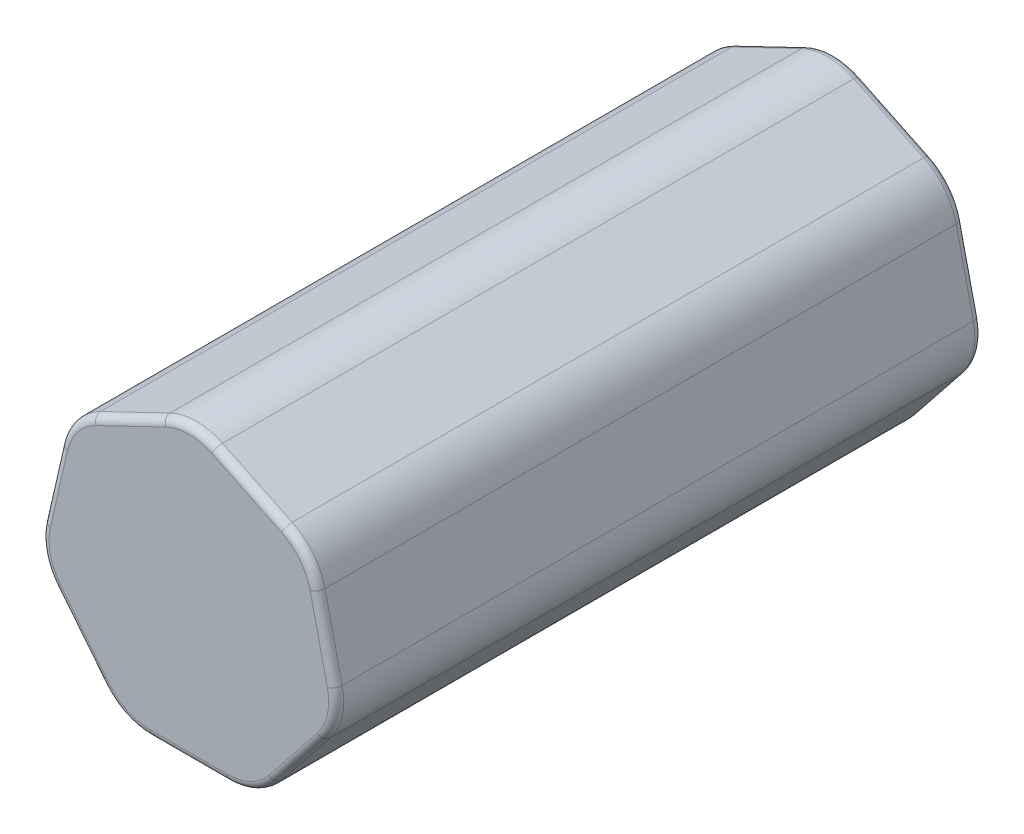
ISO-10303-21;
HEADER;
FILE_DESCRIPTION(('STEP AP214'),'2;1');
FILE_NAME('part.step','',(''),(''),'','','');
FILE_SCHEMA(('AUTOMOTIVE_DESIGN { 1 0 10303 214 1 1 1 1 }'));
ENDSEC;
DATA;
#1=APPLICATION_CONTEXT('core data for automotive mechanical design processes');
#2=APPLICATION_PROTOCOL_DEFINITION('international standard','automotive_design',2000,#1);
#3=PRODUCT_CONTEXT('',#1,'mechanical');
#4=PRODUCT('Part','Part','',(#3));
#5=PRODUCT_RELATED_PRODUCT_CATEGORY('part','',(#4));
#6=PRODUCT_DEFINITION_FORMATION('','',#4);
#7=PRODUCT_DEFINITION_CONTEXT('part definition',#1,'design');
#8=PRODUCT_DEFINITION('design','',#6,#7);
#9=PRODUCT_DEFINITION_SHAPE('','',#8);
#10=(LENGTH_UNIT() NAMED_UNIT(*) SI_UNIT(.MILLI.,.METRE.));
#11=(NAMED_UNIT(*) PLANE_ANGLE_UNIT() SI_UNIT($,.RADIAN.));
#12=(NAMED_UNIT(*) SI_UNIT($,.STERADIAN.) SOLID_ANGLE_UNIT());
#13=UNCERTAINTY_MEASURE_WITH_UNIT(LENGTH_MEASURE(1.E-05),#10,'distance_accuracy_value','');
#14=(GEOMETRIC_REPRESENTATION_CONTEXT(3) GLOBAL_UNCERTAINTY_ASSIGNED_CONTEXT((#13)) GLOBAL_UNIT_ASSIGNED_CONTEXT((#10,
#11,#12)) REPRESENTATION_CONTEXT('',''));
#15=CARTESIAN_POINT('',(0.,0.,0.));
#16=DIRECTION('',(0.,0.,1.));
#17=DIRECTION('',(1.,0.,0.));
#18=AXIS2_PLACEMENT_3D('',#15,#16,#17);
#19=CARTESIAN_POINT('',(32.0200762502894,-7.30837345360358,67.945));
#20=DIRECTION('',(-0.974927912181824,-0.222520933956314,0.));
#21=DIRECTION('',(0.222520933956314,-0.974927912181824,0.));
#22=AXIS2_PLACEMENT_3D('',#19,#20,#21);
#23=PLANE('',#22);
#24=DIRECTION('',(0.,0.,-1.));
#25=VECTOR('',#24,1.);
#26=CARTESIAN_POINT('',(27.0390449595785,14.5149505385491,67.945));
#27=LINE('',#26,#25);
#28=CARTESIAN_POINT('',(27.0390449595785,14.5149505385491,-66.3575));
#29=VERTEX_POINT('',#28);
#30=CARTESIAN_POINT('',(27.0390449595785,14.5149505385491,66.3575));
#31=VERTEX_POINT('',#30);
#32=EDGE_CURVE('E435',#29,#31,#27,.F.);
#33=ORIENTED_EDGE('',*,*,#32,.T.);
#34=DIRECTION('',(-0.222520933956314,0.974927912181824,0.));
#35=VECTOR('',#34,1.);
#36=CARTESIAN_POINT('',(30.6591387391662,-1.34571662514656,66.3575));
#37=LINE('',#36,#35);
#38=CARTESIAN_POINT('',(30.6591387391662,-1.34571662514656,66.3575));
#39=VERTEX_POINT('',#38);
#40=EDGE_CURVE('E272',#31,#39,#37,.F.);
#41=ORIENTED_EDGE('',*,*,#40,.T.);
#42=DIRECTION('',(0.,0.,-1.));
#43=VECTOR('',#42,1.);
#44=CARTESIAN_POINT('',(30.6591387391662,-1.34571662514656,67.945));
#45=LINE('',#44,#43);
#46=CARTESIAN_POINT('',(30.6591387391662,-1.34571662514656,-66.3575));
#47=VERTEX_POINT('',#46);
#48=EDGE_CURVE('E430',#39,#47,#45,.T.);
#49=ORIENTED_EDGE('',*,*,#48,.T.);
#50=DIRECTION('',(-0.222520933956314,0.974927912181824,0.));
#51=VECTOR('',#50,1.);
#52=CARTESIAN_POINT('',(32.0200762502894,-7.30837345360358,-66.3575));
#53=LINE('',#52,#51);
#54=EDGE_CURVE('E270',#47,#29,#53,.T.);
#55=ORIENTED_EDGE('',*,*,#54,.T.);
#56=EDGE_LOOP('',(#33,#41,#49,#55));
#57=FACE_BOUND('',#56,.T.);
#58=ADVANCED_FACE('F35',(#57),#23,.F.);
#59=CARTESIAN_POINT('',(25.6781074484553,20.4776073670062,67.945));
#60=DIRECTION('',(-0.433883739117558,-0.900968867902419,0.));
#61=DIRECTION('',(0.900968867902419,-0.433883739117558,0.));
#62=AXIS2_PLACEMENT_3D('',#59,#60,#61);
#63=PLANE('',#62);
#64=DIRECTION('',(0.,0.,-1.));
#65=VECTOR('',#64,1.);
#66=CARTESIAN_POINT('',(5.51032348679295,30.1899002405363,67.945));
#67=LINE('',#66,#65);
#68=CARTESIAN_POINT('',(5.51032348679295,30.1899002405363,-66.3575));
#69=VERTEX_POINT('',#68);
#70=CARTESIAN_POINT('',(5.51032348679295,30.1899002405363,66.3575));
#71=VERTEX_POINT('',#70);
#72=EDGE_CURVE('E421',#69,#71,#67,.F.);
#73=ORIENTED_EDGE('',*,*,#72,.T.);
#74=DIRECTION('',(-0.900968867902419,0.433883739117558,0.));
#75=VECTOR('',#74,1.);
#76=CARTESIAN_POINT('',(20.1677839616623,23.1312392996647,66.3575));
#77=LINE('',#76,#75);
#78=CARTESIAN_POINT('',(20.1677839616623,23.1312392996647,66.3575));
#79=VERTEX_POINT('',#78);
#80=EDGE_CURVE('E264',#71,#79,#77,.F.);
#81=ORIENTED_EDGE('',*,*,#80,.T.);
#82=DIRECTION('',(0.,0.,-1.));
#83=VECTOR('',#82,1.);
#84=CARTESIAN_POINT('',(20.1677839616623,23.1312392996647,67.945));
#85=LINE('',#84,#83);
#86=CARTESIAN_POINT('',(20.1677839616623,23.1312392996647,-66.3575));
#87=VERTEX_POINT('',#86);
#88=EDGE_CURVE('E424',#79,#87,#85,.T.);
#89=ORIENTED_EDGE('',*,*,#88,.T.);
#90=DIRECTION('',(-0.900968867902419,0.433883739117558,0.));
#91=VECTOR('',#90,1.);
#92=CARTESIAN_POINT('',(25.6781074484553,20.4776073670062,-66.3575));
#93=LINE('',#92,#91);
#94=EDGE_CURVE('E262',#87,#69,#93,.T.);
#95=ORIENTED_EDGE('',*,*,#94,.T.);
#96=EDGE_LOOP('',(#73,#81,#89,#95));
#97=FACE_BOUND('',#96,.T.);
#98=ADVANCED_FACE('F420',(#97),#63,.F.);
#99=CARTESIAN_POINT('',(0.,32.8435321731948,67.945));
#100=DIRECTION('',(0.433883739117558,-0.900968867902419,0.));
#101=DIRECTION('',(0.900968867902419,0.433883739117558,0.));
#102=AXIS2_PLACEMENT_3D('',#99,#100,#101);
#103=PLANE('',#102);
#104=DIRECTION('',(0.,0.,-1.));
#105=VECTOR('',#104,1.);
#106=CARTESIAN_POINT('',(-20.1677839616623,23.1312392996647,67.945));
#107=LINE('',#106,#105);
#108=CARTESIAN_POINT('',(-20.1677839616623,23.1312392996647,-66.3575));
#109=VERTEX_POINT('',#108);
#110=CARTESIAN_POINT('',(-20.1677839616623,23.1312392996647,66.3575));
#111=VERTEX_POINT('',#110);
#112=EDGE_CURVE('E432',#109,#111,#107,.F.);
#113=ORIENTED_EDGE('',*,*,#112,.T.);
#114=DIRECTION('',(-0.900968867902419,-0.433883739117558,0.));
#115=VECTOR('',#114,1.);
#116=CARTESIAN_POINT('',(-5.51032348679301,30.1899002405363,66.3575));
#117=LINE('',#116,#115);
#118=CARTESIAN_POINT('',(-5.51032348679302,30.1899002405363,66.3575));
#119=VERTEX_POINT('',#118);
#120=EDGE_CURVE('E256',#111,#119,#117,.F.);
#121=ORIENTED_EDGE('',*,*,#120,.T.);
#122=DIRECTION('',(0.,0.,-1.));
#123=VECTOR('',#122,1.);
#124=CARTESIAN_POINT('',(-5.51032348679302,30.1899002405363,67.945));
#125=LINE('',#124,#123);
#126=CARTESIAN_POINT('',(-5.51032348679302,30.1899002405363,-66.3575));
#127=VERTEX_POINT('',#126);
#128=EDGE_CURVE('E240',#119,#127,#125,.T.);
#129=ORIENTED_EDGE('',*,*,#128,.T.);
#130=DIRECTION('',(-0.900968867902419,-0.433883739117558,0.));
#131=VECTOR('',#130,1.);
#132=CARTESIAN_POINT('',(0.,32.8435321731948,-66.3575));
#133=LINE('',#132,#131);
#134=EDGE_CURVE('E254',#127,#109,#133,.T.);
#135=ORIENTED_EDGE('',*,*,#134,.T.);
#136=EDGE_LOOP('',(#113,#121,#129,#135));
#137=FACE_BOUND('',#136,.T.);
#138=ADVANCED_FACE('F477',(#137),#103,.F.);
#139=CARTESIAN_POINT('',(-25.6781074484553,20.4776073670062,67.945));
#140=DIRECTION('',(0.974927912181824,-0.222520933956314,0.));
#141=DIRECTION('',(0.222520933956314,0.974927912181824,0.));
#142=AXIS2_PLACEMENT_3D('',#139,#140,#141);
#143=PLANE('',#142);
#144=DIRECTION('',(0.,0.,-1.));
#145=VECTOR('',#144,1.);
#146=CARTESIAN_POINT('',(-30.6591387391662,-1.34571662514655,67.945));
#147=LINE('',#146,#145);
#148=CARTESIAN_POINT('',(-30.6591387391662,-1.34571662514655,-66.3575));
#149=VERTEX_POINT('',#148);
#150=CARTESIAN_POINT('',(-30.6591387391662,-1.34571662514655,66.3575));
#151=VERTEX_POINT('',#150);
#152=EDGE_CURVE('E493',#149,#151,#147,.F.);
#153=ORIENTED_EDGE('',*,*,#152,.T.);
#154=DIRECTION('',(-0.222520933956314,-0.974927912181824,0.));
#155=VECTOR('',#154,1.);
#156=CARTESIAN_POINT('',(-27.0390449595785,14.5149505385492,66.3575));
#157=LINE('',#156,#155);
#158=CARTESIAN_POINT('',(-27.0390449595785,14.5149505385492,66.3575));
#159=VERTEX_POINT('',#158);
#160=EDGE_CURVE('E305',#151,#159,#157,.F.);
#161=ORIENTED_EDGE('',*,*,#160,.T.);
#162=DIRECTION('',(0.,0.,-1.));
#163=VECTOR('',#162,1.);
#164=CARTESIAN_POINT('',(-27.0390449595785,14.5149505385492,67.945));
#165=LINE('',#164,#163);
#166=CARTESIAN_POINT('',(-27.0390449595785,14.5149505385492,-66.3575));
#167=VERTEX_POINT('',#166);
#168=EDGE_CURVE('E476',#159,#167,#165,.T.);
#169=ORIENTED_EDGE('',*,*,#168,.T.);
#170=DIRECTION('',(-0.222520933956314,-0.974927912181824,0.));
#171=VECTOR('',#170,1.);
#172=CARTESIAN_POINT('',(-25.6781074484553,20.4776073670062,-66.3575));
#173=LINE('',#172,#171);
#174=EDGE_CURVE('E303',#167,#149,#173,.T.);
#175=ORIENTED_EDGE('',*,*,#174,.T.);
#176=EDGE_LOOP('',(#153,#161,#169,#175));
#177=FACE_BOUND('',#176,.T.);
#178=ADVANCED_FACE('F491',(#177),#143,.F.);
#179=CARTESIAN_POINT('',(-32.0200762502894,-7.30837345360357,67.945));
#180=DIRECTION('',(0.78183148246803,0.623489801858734,0.));
#181=DIRECTION('',(-0.623489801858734,0.78183148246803,0.));
#182=AXIS2_PLACEMENT_3D('',#179,#180,#181);
#183=PLANE('',#182);
#184=DIRECTION('',(0.,0.,-1.));
#185=VECTOR('',#184,1.);
#186=CARTESIAN_POINT('',(-18.0635367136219,-24.8093204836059,67.945));
#187=LINE('',#186,#185);
#188=CARTESIAN_POINT('',(-18.0635367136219,-24.8093204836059,-66.3575));
#189=VERTEX_POINT('',#188);
#190=CARTESIAN_POINT('',(-18.0635367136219,-24.8093204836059,66.3575));
#191=VERTEX_POINT('',#190);
#192=EDGE_CURVE('E366',#189,#191,#187,.F.);
#193=ORIENTED_EDGE('',*,*,#192,.T.);
#194=DIRECTION('',(0.623489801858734,-0.78183148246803,0.));
#195=VECTOR('',#194,1.);
#196=CARTESIAN_POINT('',(-28.206814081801,-12.0900529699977,66.3575));
#197=LINE('',#196,#195);
#198=CARTESIAN_POINT('',(-28.206814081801,-12.0900529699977,66.3575));
#199=VERTEX_POINT('',#198);
#200=EDGE_CURVE('E297',#191,#199,#197,.F.);
#201=ORIENTED_EDGE('',*,*,#200,.T.);
#202=DIRECTION('',(0.,0.,-1.));
#203=VECTOR('',#202,1.);
#204=CARTESIAN_POINT('',(-28.206814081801,-12.0900529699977,67.945));
#205=LINE('',#204,#203);
#206=CARTESIAN_POINT('',(-28.206814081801,-12.0900529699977,-66.3575));
#207=VERTEX_POINT('',#206);
#208=EDGE_CURVE('E494',#199,#207,#205,.T.);
#209=ORIENTED_EDGE('',*,*,#208,.T.);
#210=DIRECTION('',(0.623489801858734,-0.78183148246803,0.));
#211=VECTOR('',#210,1.);
#212=CARTESIAN_POINT('',(-32.0200762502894,-7.30837345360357,-66.3575));
#213=LINE('',#212,#211);
#214=EDGE_CURVE('E295',#207,#189,#213,.T.);
#215=ORIENTED_EDGE('',*,*,#214,.T.);
#216=EDGE_LOOP('',(#193,#201,#209,#215));
#217=FACE_BOUND('',#216,.T.);
#218=ADVANCED_FACE('F802',(#217),#183,.F.);
#219=CARTESIAN_POINT('',(-14.2502745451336,-29.591,67.945));
#220=DIRECTION('',(0.,1.,0.));
#221=DIRECTION('',(-1.,0.,0.));
#222=AXIS2_PLACEMENT_3D('',#219,#220,#221);
#223=PLANE('',#222);
#224=DIRECTION('',(0.,0.,-1.));
#225=VECTOR('',#224,1.);
#226=CARTESIAN_POINT('',(8.13427688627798,-29.591,67.945));
#227=LINE('',#226,#225);
#228=CARTESIAN_POINT('',(8.13427688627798,-29.591,-66.3575));
#229=VERTEX_POINT('',#228);
#230=CARTESIAN_POINT('',(8.13427688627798,-29.591,66.3575));
#231=VERTEX_POINT('',#230);
#232=EDGE_CURVE('E496',#229,#231,#227,.F.);
#233=ORIENTED_EDGE('',*,*,#232,.T.);
#234=DIRECTION('',(1.,0.,0.));
#235=VECTOR('',#234,1.);
#236=CARTESIAN_POINT('',(-8.13427688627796,-29.591,66.3575));
#237=LINE('',#236,#235);
#238=CARTESIAN_POINT('',(-8.13427688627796,-29.591,66.3575));
#239=VERTEX_POINT('',#238);
#240=EDGE_CURVE('E288',#231,#239,#237,.F.);
#241=ORIENTED_EDGE('',*,*,#240,.T.);
#242=DIRECTION('',(0.,0.,-1.));
#243=VECTOR('',#242,1.);
#244=CARTESIAN_POINT('',(-8.13427688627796,-29.591,67.945));
#245=LINE('',#244,#243);
#246=CARTESIAN_POINT('',(-8.13427688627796,-29.591,-66.3575));
#247=VERTEX_POINT('',#246);
#248=EDGE_CURVE('E504',#239,#247,#245,.T.);
#249=ORIENTED_EDGE('',*,*,#248,.T.);
#250=DIRECTION('',(1.,0.,0.));
#251=VECTOR('',#250,1.);
#252=CARTESIAN_POINT('',(-14.2502745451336,-29.591,-66.3575));
#253=LINE('',#252,#251);
#254=EDGE_CURVE('E286',#247,#229,#253,.T.);
#255=ORIENTED_EDGE('',*,*,#254,.T.);
#256=EDGE_LOOP('',(#233,#241,#249,#255));
#257=FACE_BOUND('',#256,.T.);
#258=ADVANCED_FACE('F558',(#257),#223,.F.);
#259=CARTESIAN_POINT('',(14.2502745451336,-29.591,67.945));
#260=DIRECTION('',(-0.78183148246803,0.623489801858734,0.));
#261=DIRECTION('',(-0.623489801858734,-0.78183148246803,0.));
#262=AXIS2_PLACEMENT_3D('',#259,#260,#261);
#263=PLANE('',#262);
#264=DIRECTION('',(0.,0.,-1.));
#265=VECTOR('',#264,1.);
#266=CARTESIAN_POINT('',(28.206814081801,-12.0900529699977,67.945));
#267=LINE('',#266,#265);
#268=CARTESIAN_POINT('',(28.206814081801,-12.0900529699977,-66.3575));
#269=VERTEX_POINT('',#268);
#270=CARTESIAN_POINT('',(28.206814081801,-12.0900529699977,66.3575));
#271=VERTEX_POINT('',#270);
#272=EDGE_CURVE('E507',#269,#271,#267,.F.);
#273=ORIENTED_EDGE('',*,*,#272,.T.);
#274=DIRECTION('',(0.623489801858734,0.78183148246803,0.));
#275=VECTOR('',#274,1.);
#276=CARTESIAN_POINT('',(18.0635367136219,-24.8093204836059,66.3575));
#277=LINE('',#276,#275);
#278=CARTESIAN_POINT('',(18.063536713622,-24.8093204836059,66.3575));
#279=VERTEX_POINT('',#278);
#280=EDGE_CURVE('E280',#271,#279,#277,.F.);
#281=ORIENTED_EDGE('',*,*,#280,.T.);
#282=DIRECTION('',(0.,0.,-1.));
#283=VECTOR('',#282,1.);
#284=CARTESIAN_POINT('',(18.063536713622,-24.8093204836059,67.945));
#285=LINE('',#284,#283);
#286=CARTESIAN_POINT('',(18.063536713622,-24.8093204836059,-66.3575));
#287=VERTEX_POINT('',#286);
#288=EDGE_CURVE('E510',#279,#287,#285,.T.);
#289=ORIENTED_EDGE('',*,*,#288,.T.);
#290=DIRECTION('',(0.623489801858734,0.78183148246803,0.));
#291=VECTOR('',#290,1.);
#292=CARTESIAN_POINT('',(14.2502745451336,-29.591,-66.3575));
#293=LINE('',#292,#291);
#294=EDGE_CURVE('E278',#287,#269,#293,.T.);
#295=ORIENTED_EDGE('',*,*,#294,.T.);
#296=EDGE_LOOP('',(#273,#281,#289,#295));
#297=FACE_BOUND('',#296,.T.);
#298=ADVANCED_FACE('F541',(#297),#263,.F.);
#299=CARTESIAN_POINT('',(0.,0.,67.945));
#300=DIRECTION('',(0.,0.,1.));
#301=DIRECTION('',(1.,0.,0.));
#302=AXIS2_PLACEMENT_3D('',#299,#300,#301);
#303=PLANE('',#302);
#304=DIRECTION('',(-0.900968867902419,-0.433883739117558,0.));
#305=VECTOR('',#304,1.);
#306=CARTESIAN_POINT('',(-19.4789935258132,21.7009512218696,67.945));
#307=LINE('',#306,#305);
#308=CARTESIAN_POINT('',(-4.82153305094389,28.7596121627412,67.945));
#309=VERTEX_POINT('',#308);
#310=CARTESIAN_POINT('',(-19.4789935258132,21.7009512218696,67.945));
#311=VERTEX_POINT('',#310);
#312=EDGE_CURVE('E244',#309,#311,#307,.T.);
#313=ORIENTED_EDGE('',*,*,#312,.T.);
#314=CARTESIAN_POINT('',(-14.6574604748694,11.688934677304,67.945));
#315=DIRECTION('',(0.,0.,1.));
#316=DIRECTION('',(1.,0.,0.));
#317=AXIS2_PLACEMENT_3D('',#314,#315,#316);
#318=CIRCLE('',#317,11.1125);
#319=CARTESIAN_POINT('',(-25.4913468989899,14.1616985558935,67.945));
#320=VERTEX_POINT('',#319);
#321=EDGE_CURVE('E225',#311,#320,#318,.T.);
#322=ORIENTED_EDGE('',*,*,#321,.T.);
#323=DIRECTION('',(-0.222520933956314,-0.974927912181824,0.));
#324=VECTOR('',#323,1.);
#325=CARTESIAN_POINT('',(-29.1114406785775,-1.6989686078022,67.945));
#326=LINE('',#325,#324);
#327=CARTESIAN_POINT('',(-29.1114406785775,-1.6989686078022,67.945));
#328=VERTEX_POINT('',#327);
#329=EDGE_CURVE('E233',#320,#328,#326,.T.);
#330=ORIENTED_EDGE('',*,*,#329,.T.);
#331=CARTESIAN_POINT('',(-18.277554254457,-4.17173248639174,67.945));
#332=DIRECTION('',(0.,0.,1.));
#333=DIRECTION('',(1.,0.,0.));
#334=AXIS2_PLACEMENT_3D('',#331,#332,#333);
#335=CIRCLE('',#334,11.1125);
#336=CARTESIAN_POINT('',(-26.965656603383,-11.1002629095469,67.945));
#337=VERTEX_POINT('',#336);
#338=EDGE_CURVE('E239',#328,#337,#335,.T.);
#339=ORIENTED_EDGE('',*,*,#338,.T.);
#340=DIRECTION('',(0.623489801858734,-0.78183148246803,0.));
#341=VECTOR('',#340,1.);
#342=CARTESIAN_POINT('',(-16.8223792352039,-23.8195304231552,67.945));
#343=LINE('',#342,#341);
#344=CARTESIAN_POINT('',(-16.8223792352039,-23.8195304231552,67.945));
#345=VERTEX_POINT('',#344);
#346=EDGE_CURVE('E443',#337,#345,#343,.T.);
#347=ORIENTED_EDGE('',*,*,#346,.T.);
#348=CARTESIAN_POINT('',(-8.13427688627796,-16.891,67.945));
#349=DIRECTION('',(0.,0.,1.));
#350=DIRECTION('',(1.,0.,0.));
#351=AXIS2_PLACEMENT_3D('',#348,#349,#350);
#352=CIRCLE('',#351,11.1125);
#353=CARTESIAN_POINT('',(-8.13427688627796,-28.0035,67.945));
#354=VERTEX_POINT('',#353);
#355=EDGE_CURVE('E445',#345,#354,#352,.T.);
#356=ORIENTED_EDGE('',*,*,#355,.T.);
#357=DIRECTION('',(1.,0.,0.));
#358=VECTOR('',#357,1.);
#359=CARTESIAN_POINT('',(8.13427688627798,-28.0035,67.945));
#360=LINE('',#359,#358);
#361=CARTESIAN_POINT('',(8.13427688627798,-28.0035,67.945));
#362=VERTEX_POINT('',#361);
#363=EDGE_CURVE('E447',#354,#362,#360,.T.);
#364=ORIENTED_EDGE('',*,*,#363,.T.);
#365=CARTESIAN_POINT('',(8.13427688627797,-16.891,67.945));
#366=DIRECTION('',(0.,0.,1.));
#367=DIRECTION('',(1.,0.,0.));
#368=AXIS2_PLACEMENT_3D('',#365,#366,#367);
#369=CIRCLE('',#368,11.1125);
#370=CARTESIAN_POINT('',(16.822379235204,-23.8195304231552,67.945));
#371=VERTEX_POINT('',#370);
#372=EDGE_CURVE('E449',#362,#371,#369,.T.);
#373=ORIENTED_EDGE('',*,*,#372,.T.);
#374=DIRECTION('',(0.623489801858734,0.78183148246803,0.));
#375=VECTOR('',#374,1.);
#376=CARTESIAN_POINT('',(26.965656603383,-11.1002629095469,67.945));
#377=LINE('',#376,#375);
#378=CARTESIAN_POINT('',(26.965656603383,-11.1002629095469,67.945));
#379=VERTEX_POINT('',#378);
#380=EDGE_CURVE('E451',#371,#379,#377,.T.);
#381=ORIENTED_EDGE('',*,*,#380,.T.);
#382=CARTESIAN_POINT('',(18.277554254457,-4.17173248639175,67.945));
#383=DIRECTION('',(0.,0.,1.));
#384=DIRECTION('',(1.,0.,0.));
#385=AXIS2_PLACEMENT_3D('',#382,#383,#384);
#386=CIRCLE('',#385,11.1125);
#387=CARTESIAN_POINT('',(29.1114406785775,-1.69896860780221,67.945));
#388=VERTEX_POINT('',#387);
#389=EDGE_CURVE('E453',#379,#388,#386,.T.);
#390=ORIENTED_EDGE('',*,*,#389,.T.);
#391=DIRECTION('',(-0.222520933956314,0.974927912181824,0.));
#392=VECTOR('',#391,1.);
#393=CARTESIAN_POINT('',(25.4913468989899,14.1616985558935,67.945));
#394=LINE('',#393,#392);
#395=CARTESIAN_POINT('',(25.4913468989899,14.1616985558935,67.945));
#396=VERTEX_POINT('',#395);
#397=EDGE_CURVE('E455',#388,#396,#394,.T.);
#398=ORIENTED_EDGE('',*,*,#397,.T.);
#399=CARTESIAN_POINT('',(14.6574604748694,11.6889346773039,67.945));
#400=DIRECTION('',(0.,0.,1.));
#401=DIRECTION('',(1.,0.,0.));
#402=AXIS2_PLACEMENT_3D('',#399,#400,#401);
#403=CIRCLE('',#402,11.1125);
#404=CARTESIAN_POINT('',(19.4789935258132,21.7009512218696,67.945));
#405=VERTEX_POINT('',#404);
#406=EDGE_CURVE('E457',#396,#405,#403,.T.);
#407=ORIENTED_EDGE('',*,*,#406,.T.);
#408=DIRECTION('',(-0.900968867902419,0.433883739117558,0.));
#409=VECTOR('',#408,1.);
#410=CARTESIAN_POINT('',(4.82153305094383,28.7596121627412,67.945));
#411=LINE('',#410,#409);
#412=CARTESIAN_POINT('',(4.82153305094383,28.7596121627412,67.945));
#413=VERTEX_POINT('',#412);
#414=EDGE_CURVE('E459',#405,#413,#411,.T.);
#415=ORIENTED_EDGE('',*,*,#414,.T.);
#416=CARTESIAN_POINT('',(0.,18.7475956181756,67.945));
#417=DIRECTION('',(0.,0.,1.));
#418=DIRECTION('',(1.,0.,0.));
#419=AXIS2_PLACEMENT_3D('',#416,#417,#418);
#420=CIRCLE('',#419,11.1125);
#421=EDGE_CURVE('E249',#413,#309,#420,.T.);
#422=ORIENTED_EDGE('',*,*,#421,.T.);
#423=EDGE_LOOP('',(#313,#322,#330,#339,#347,#356,#364,#373,#381,#390,#398,#407,#415,#422));
#424=FACE_BOUND('',#423,.T.);
#425=ADVANCED_FACE('F242',(#424),#303,.T.);
#426=CARTESIAN_POINT('',(0.,0.,-67.945));
#427=DIRECTION('',(0.,0.,1.));
#428=DIRECTION('',(1.,0.,0.));
#429=AXIS2_PLACEMENT_3D('',#426,#427,#428);
#430=PLANE('',#429);
#431=DIRECTION('',(1.,0.,0.));
#432=VECTOR('',#431,1.);
#433=CARTESIAN_POINT('',(0.,-28.0035,-67.945));
#434=LINE('',#433,#432);
#435=CARTESIAN_POINT('',(8.13427688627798,-28.0035,-67.945));
#436=VERTEX_POINT('',#435);
#437=CARTESIAN_POINT('',(-8.13427688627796,-28.0035,-67.945));
#438=VERTEX_POINT('',#437);
#439=EDGE_CURVE('E44',#436,#438,#434,.F.);
#440=ORIENTED_EDGE('',*,*,#439,.T.);
#441=CARTESIAN_POINT('',(-8.13427688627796,-16.891,-67.945));
#442=DIRECTION('',(0.,0.,1.));
#443=DIRECTION('',(1.,0.,0.));
#444=AXIS2_PLACEMENT_3D('',#441,#442,#443);
#445=CIRCLE('',#444,11.1125);
#446=CARTESIAN_POINT('',(-16.8223792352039,-23.8195304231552,-67.945));
#447=VERTEX_POINT('',#446);
#448=EDGE_CURVE('E11',#438,#447,#445,.F.);
#449=ORIENTED_EDGE('',*,*,#448,.T.);
#450=DIRECTION('',(0.623489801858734,-0.78183148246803,0.));
#451=VECTOR('',#450,1.);
#452=CARTESIAN_POINT('',(-21.8940179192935,-17.4598966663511,-67.945));
#453=LINE('',#452,#451);
#454=CARTESIAN_POINT('',(-26.965656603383,-11.1002629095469,-67.945));
#455=VERTEX_POINT('',#454);
#456=EDGE_CURVE('E307',#447,#455,#453,.F.);
#457=ORIENTED_EDGE('',*,*,#456,.T.);
#458=CARTESIAN_POINT('',(-18.277554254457,-4.17173248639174,-67.945));
#459=DIRECTION('',(0.,0.,1.));
#460=DIRECTION('',(1.,0.,0.));
#461=AXIS2_PLACEMENT_3D('',#458,#459,#460);
#462=CIRCLE('',#461,11.1125);
#463=CARTESIAN_POINT('',(-29.1114406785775,-1.6989686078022,-67.945));
#464=VERTEX_POINT('',#463);
#465=EDGE_CURVE('E309',#455,#464,#462,.F.);
#466=ORIENTED_EDGE('',*,*,#465,.T.);
#467=DIRECTION('',(-0.222520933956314,-0.974927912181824,0.));
#468=VECTOR('',#467,1.);
#469=CARTESIAN_POINT('',(-27.3013937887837,6.23136497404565,-67.945));
#470=LINE('',#469,#468);
#471=CARTESIAN_POINT('',(-25.4913468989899,14.1616985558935,-67.945));
#472=VERTEX_POINT('',#471);
#473=EDGE_CURVE('E311',#464,#472,#470,.F.);
#474=ORIENTED_EDGE('',*,*,#473,.T.);
#475=CARTESIAN_POINT('',(-14.6574604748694,11.688934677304,-67.945));
#476=DIRECTION('',(0.,0.,1.));
#477=DIRECTION('',(1.,0.,0.));
#478=AXIS2_PLACEMENT_3D('',#475,#476,#477);
#479=CIRCLE('',#478,11.1125);
#480=CARTESIAN_POINT('',(-19.4789935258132,21.7009512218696,-67.945));
#481=VERTEX_POINT('',#480);
#482=EDGE_CURVE('E313',#472,#481,#479,.F.);
#483=ORIENTED_EDGE('',*,*,#482,.T.);
#484=DIRECTION('',(-0.900968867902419,-0.433883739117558,0.));
#485=VECTOR('',#484,1.);
#486=CARTESIAN_POINT('',(-12.1502632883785,25.2302816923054,-67.945));
#487=LINE('',#486,#485);
#488=CARTESIAN_POINT('',(-4.82153305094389,28.7596121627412,-67.945));
#489=VERTEX_POINT('',#488);
#490=EDGE_CURVE('E315',#481,#489,#487,.F.);
#491=ORIENTED_EDGE('',*,*,#490,.T.);
#492=CARTESIAN_POINT('',(0.,18.7475956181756,-67.945));
#493=DIRECTION('',(0.,0.,1.));
#494=DIRECTION('',(1.,0.,0.));
#495=AXIS2_PLACEMENT_3D('',#492,#493,#494);
#496=CIRCLE('',#495,11.1125);
#497=CARTESIAN_POINT('',(4.82153305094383,28.7596121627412,-67.945));
#498=VERTEX_POINT('',#497);
#499=EDGE_CURVE('E317',#489,#498,#496,.F.);
#500=ORIENTED_EDGE('',*,*,#499,.T.);
#501=DIRECTION('',(-0.900968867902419,0.433883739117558,0.));
#502=VECTOR('',#501,1.);
#503=CARTESIAN_POINT('',(12.1502632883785,25.2302816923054,-67.945));
#504=LINE('',#503,#502);
#505=CARTESIAN_POINT('',(19.4789935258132,21.7009512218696,-67.945));
#506=VERTEX_POINT('',#505);
#507=EDGE_CURVE('E319',#498,#506,#504,.F.);
#508=ORIENTED_EDGE('',*,*,#507,.T.);
#509=CARTESIAN_POINT('',(14.6574604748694,11.6889346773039,-67.945));
#510=DIRECTION('',(0.,0.,1.));
#511=DIRECTION('',(1.,0.,0.));
#512=AXIS2_PLACEMENT_3D('',#509,#510,#511);
#513=CIRCLE('',#512,11.1125);
#514=CARTESIAN_POINT('',(25.4913468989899,14.1616985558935,-67.945));
#515=VERTEX_POINT('',#514);
#516=EDGE_CURVE('E321',#506,#515,#513,.F.);
#517=ORIENTED_EDGE('',*,*,#516,.T.);
#518=DIRECTION('',(-0.222520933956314,0.974927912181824,0.));
#519=VECTOR('',#518,1.);
#520=CARTESIAN_POINT('',(27.3013937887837,6.23136497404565,-67.945));
#521=LINE('',#520,#519);
#522=CARTESIAN_POINT('',(29.1114406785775,-1.69896860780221,-67.945));
#523=VERTEX_POINT('',#522);
#524=EDGE_CURVE('E323',#515,#523,#521,.F.);
#525=ORIENTED_EDGE('',*,*,#524,.T.);
#526=CARTESIAN_POINT('',(18.277554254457,-4.17173248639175,-67.945));
#527=DIRECTION('',(0.,0.,1.));
#528=DIRECTION('',(1.,0.,0.));
#529=AXIS2_PLACEMENT_3D('',#526,#527,#528);
#530=CIRCLE('',#529,11.1125);
#531=CARTESIAN_POINT('',(26.965656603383,-11.1002629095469,-67.945));
#532=VERTEX_POINT('',#531);
#533=EDGE_CURVE('E325',#523,#532,#530,.F.);
#534=ORIENTED_EDGE('',*,*,#533,.T.);
#535=DIRECTION('',(0.623489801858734,0.78183148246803,0.));
#536=VECTOR('',#535,1.);
#537=CARTESIAN_POINT('',(21.8940179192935,-17.4598966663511,-67.945));
#538=LINE('',#537,#536);
#539=CARTESIAN_POINT('',(16.822379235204,-23.8195304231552,-67.945));
#540=VERTEX_POINT('',#539);
#541=EDGE_CURVE('E327',#532,#540,#538,.F.);
#542=ORIENTED_EDGE('',*,*,#541,.T.);
#543=CARTESIAN_POINT('',(8.13427688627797,-16.891,-67.945));
#544=DIRECTION('',(0.,0.,1.));
#545=DIRECTION('',(1.,0.,0.));
#546=AXIS2_PLACEMENT_3D('',#543,#544,#545);
#547=CIRCLE('',#546,11.1125);
#548=EDGE_CURVE('E55',#540,#436,#547,.F.);
#549=ORIENTED_EDGE('',*,*,#548,.T.);
#550=EDGE_LOOP('',(#440,#449,#457,#466,#474,#483,#491,#500,#508,#517,#525,#534,#542,#549));
#551=FACE_BOUND('',#550,.T.);
#552=ADVANCED_FACE('F579',(#551),#430,.F.);
#553=CARTESIAN_POINT('',(-18.277554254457,-4.17173248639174,67.945));
#554=DIRECTION('',(0.,0.,-1.));
#555=DIRECTION('',(-1.,0.,0.));
#556=AXIS2_PLACEMENT_3D('',#553,#554,#555);
#557=CYLINDRICAL_SURFACE('',#556,12.7);
#558=ORIENTED_EDGE('',*,*,#208,.F.);
#559=CARTESIAN_POINT('',(-18.277554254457,-4.17173248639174,66.3575));
#560=DIRECTION('',(0.,0.,1.));
#561=DIRECTION('',(1.,0.,0.));
#562=AXIS2_PLACEMENT_3D('',#559,#560,#561);
#563=CIRCLE('',#562,12.7);
#564=EDGE_CURVE('E301',#199,#151,#563,.F.);
#565=ORIENTED_EDGE('',*,*,#564,.T.);
#566=ORIENTED_EDGE('',*,*,#152,.F.);
#567=CARTESIAN_POINT('',(-18.277554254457,-4.17173248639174,-66.3575));
#568=DIRECTION('',(0.,0.,1.));
#569=DIRECTION('',(1.,0.,0.));
#570=AXIS2_PLACEMENT_3D('',#567,#568,#569);
#571=CIRCLE('',#570,12.7);
#572=EDGE_CURVE('E299',#149,#207,#571,.T.);
#573=ORIENTED_EDGE('',*,*,#572,.T.);
#574=EDGE_LOOP('',(#558,#565,#566,#573));
#575=FACE_BOUND('',#574,.T.);
#576=ADVANCED_FACE('F581',(#575),#557,.T.);
#577=CARTESIAN_POINT('',(-8.13427688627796,-16.891,67.945));
#578=DIRECTION('',(0.,0.,-1.));
#579=DIRECTION('',(-1.,0.,0.));
#580=AXIS2_PLACEMENT_3D('',#577,#578,#579);
#581=CYLINDRICAL_SURFACE('',#580,12.7);
#582=ORIENTED_EDGE('',*,*,#248,.F.);
#583=CARTESIAN_POINT('',(-8.13427688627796,-16.891,66.3575));
#584=DIRECTION('',(0.,0.,1.));
#585=DIRECTION('',(1.,0.,0.));
#586=AXIS2_PLACEMENT_3D('',#583,#584,#585);
#587=CIRCLE('',#586,12.7);
#588=EDGE_CURVE('E293',#239,#191,#587,.F.);
#589=ORIENTED_EDGE('',*,*,#588,.T.);
#590=ORIENTED_EDGE('',*,*,#192,.F.);
#591=CARTESIAN_POINT('',(-8.13427688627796,-16.891,-66.3575));
#592=DIRECTION('',(0.,0.,1.));
#593=DIRECTION('',(1.,0.,0.));
#594=AXIS2_PLACEMENT_3D('',#591,#592,#593);
#595=CIRCLE('',#594,12.7);
#596=EDGE_CURVE('E290',#189,#247,#595,.T.);
#597=ORIENTED_EDGE('',*,*,#596,.T.);
#598=EDGE_LOOP('',(#582,#589,#590,#597));
#599=FACE_BOUND('',#598,.T.);
#600=ADVANCED_FACE('F567',(#599),#581,.T.);
#601=CARTESIAN_POINT('',(8.13427688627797,-16.891,67.945));
#602=DIRECTION('',(0.,0.,-1.));
#603=DIRECTION('',(-1.,0.,0.));
#604=AXIS2_PLACEMENT_3D('',#601,#602,#603);
#605=CYLINDRICAL_SURFACE('',#604,12.7);
#606=ORIENTED_EDGE('',*,*,#288,.F.);
#607=CARTESIAN_POINT('',(8.13427688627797,-16.891,66.3575));
#608=DIRECTION('',(0.,0.,1.));
#609=DIRECTION('',(1.,0.,0.));
#610=AXIS2_PLACEMENT_3D('',#607,#608,#609);
#611=CIRCLE('',#610,12.7);
#612=EDGE_CURVE('E284',#279,#231,#611,.F.);
#613=ORIENTED_EDGE('',*,*,#612,.T.);
#614=ORIENTED_EDGE('',*,*,#232,.F.);
#615=CARTESIAN_POINT('',(8.13427688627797,-16.891,-66.3575));
#616=DIRECTION('',(0.,0.,1.));
#617=DIRECTION('',(1.,0.,0.));
#618=AXIS2_PLACEMENT_3D('',#615,#616,#617);
#619=CIRCLE('',#618,12.7);
#620=EDGE_CURVE('E282',#229,#287,#619,.T.);
#621=ORIENTED_EDGE('',*,*,#620,.T.);
#622=EDGE_LOOP('',(#606,#613,#614,#621));
#623=FACE_BOUND('',#622,.T.);
#624=ADVANCED_FACE('F555',(#623),#605,.T.);
#625=CARTESIAN_POINT('',(18.277554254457,-4.17173248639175,67.945));
#626=DIRECTION('',(0.,0.,-1.));
#627=DIRECTION('',(-1.,0.,0.));
#628=AXIS2_PLACEMENT_3D('',#625,#626,#627);
#629=CYLINDRICAL_SURFACE('',#628,12.7);
#630=ORIENTED_EDGE('',*,*,#48,.F.);
#631=CARTESIAN_POINT('',(18.277554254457,-4.17173248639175,66.3575));
#632=DIRECTION('',(0.,0.,1.));
#633=DIRECTION('',(1.,0.,0.));
#634=AXIS2_PLACEMENT_3D('',#631,#632,#633);
#635=CIRCLE('',#634,12.7);
#636=EDGE_CURVE('E276',#39,#271,#635,.F.);
#637=ORIENTED_EDGE('',*,*,#636,.T.);
#638=ORIENTED_EDGE('',*,*,#272,.F.);
#639=CARTESIAN_POINT('',(18.277554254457,-4.17173248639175,-66.3575));
#640=DIRECTION('',(0.,0.,1.));
#641=DIRECTION('',(1.,0.,0.));
#642=AXIS2_PLACEMENT_3D('',#639,#640,#641);
#643=CIRCLE('',#642,12.7);
#644=EDGE_CURVE('E274',#269,#47,#643,.T.);
#645=ORIENTED_EDGE('',*,*,#644,.T.);
#646=EDGE_LOOP('',(#630,#637,#638,#645));
#647=FACE_BOUND('',#646,.T.);
#648=ADVANCED_FACE('F537',(#647),#629,.T.);
#649=CARTESIAN_POINT('',(14.6574604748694,11.6889346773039,67.945));
#650=DIRECTION('',(0.,0.,-1.));
#651=DIRECTION('',(-1.,0.,0.));
#652=AXIS2_PLACEMENT_3D('',#649,#650,#651);
#653=CYLINDRICAL_SURFACE('',#652,12.7);
#654=ORIENTED_EDGE('',*,*,#88,.F.);
#655=CARTESIAN_POINT('',(14.6574604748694,11.6889346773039,66.3575));
#656=DIRECTION('',(0.,0.,1.));
#657=DIRECTION('',(1.,0.,0.));
#658=AXIS2_PLACEMENT_3D('',#655,#656,#657);
#659=CIRCLE('',#658,12.7);
#660=EDGE_CURVE('E268',#79,#31,#659,.F.);
#661=ORIENTED_EDGE('',*,*,#660,.T.);
#662=ORIENTED_EDGE('',*,*,#32,.F.);
#663=CARTESIAN_POINT('',(14.6574604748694,11.6889346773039,-66.3575));
#664=DIRECTION('',(0.,0.,1.));
#665=DIRECTION('',(1.,0.,0.));
#666=AXIS2_PLACEMENT_3D('',#663,#664,#665);
#667=CIRCLE('',#666,12.7);
#668=EDGE_CURVE('E266',#29,#87,#667,.T.);
#669=ORIENTED_EDGE('',*,*,#668,.T.);
#670=EDGE_LOOP('',(#654,#661,#662,#669));
#671=FACE_BOUND('',#670,.T.);
#672=ADVANCED_FACE('F605',(#671),#653,.T.);
#673=CARTESIAN_POINT('',(0.,18.7475956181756,67.945));
#674=DIRECTION('',(0.,0.,-1.));
#675=DIRECTION('',(-1.,0.,0.));
#676=AXIS2_PLACEMENT_3D('',#673,#674,#675);
#677=CYLINDRICAL_SURFACE('',#676,12.7);
#678=ORIENTED_EDGE('',*,*,#128,.F.);
#679=CARTESIAN_POINT('',(0.,18.7475956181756,66.3575));
#680=DIRECTION('',(0.,0.,1.));
#681=DIRECTION('',(1.,0.,0.));
#682=AXIS2_PLACEMENT_3D('',#679,#680,#681);
#683=CIRCLE('',#682,12.7);
#684=EDGE_CURVE('E260',#119,#71,#683,.F.);
#685=ORIENTED_EDGE('',*,*,#684,.T.);
#686=ORIENTED_EDGE('',*,*,#72,.F.);
#687=CARTESIAN_POINT('',(0.,18.7475956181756,-66.3575));
#688=DIRECTION('',(0.,0.,1.));
#689=DIRECTION('',(1.,0.,0.));
#690=AXIS2_PLACEMENT_3D('',#687,#688,#689);
#691=CIRCLE('',#690,12.7);
#692=EDGE_CURVE('E258',#69,#127,#691,.T.);
#693=ORIENTED_EDGE('',*,*,#692,.T.);
#694=EDGE_LOOP('',(#678,#685,#686,#693));
#695=FACE_BOUND('',#694,.T.);
#696=ADVANCED_FACE('F427',(#695),#677,.T.);
#697=CARTESIAN_POINT('',(-14.6574604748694,11.688934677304,67.945));
#698=DIRECTION('',(0.,0.,-1.));
#699=DIRECTION('',(-1.,0.,0.));
#700=AXIS2_PLACEMENT_3D('',#697,#698,#699);
#701=CYLINDRICAL_SURFACE('',#700,12.7);
#702=ORIENTED_EDGE('',*,*,#168,.F.);
#703=CARTESIAN_POINT('',(-14.6574604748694,11.688934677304,66.3575));
#704=DIRECTION('',(0.,0.,1.));
#705=DIRECTION('',(1.,0.,0.));
#706=AXIS2_PLACEMENT_3D('',#703,#704,#705);
#707=CIRCLE('',#706,12.7);
#708=EDGE_CURVE('E227',#159,#111,#707,.F.);
#709=ORIENTED_EDGE('',*,*,#708,.T.);
#710=ORIENTED_EDGE('',*,*,#112,.F.);
#711=CARTESIAN_POINT('',(-14.6574604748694,11.688934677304,-66.3575));
#712=DIRECTION('',(0.,0.,1.));
#713=DIRECTION('',(1.,0.,0.));
#714=AXIS2_PLACEMENT_3D('',#711,#712,#713);
#715=CIRCLE('',#714,12.7);
#716=EDGE_CURVE('E246',#109,#167,#715,.T.);
#717=ORIENTED_EDGE('',*,*,#716,.T.);
#718=EDGE_LOOP('',(#702,#709,#710,#717));
#719=FACE_BOUND('',#718,.T.);
#720=ADVANCED_FACE('F473',(#719),#701,.T.);
#721=CARTESIAN_POINT('',(21.8940179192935,-17.4598966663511,66.3575));
#722=DIRECTION('',(-0.623489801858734,-0.78183148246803,0.));
#723=DIRECTION('',(0.78183148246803,-0.623489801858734,0.));
#724=AXIS2_PLACEMENT_3D('',#721,#722,#723);
#725=CYLINDRICAL_SURFACE('',#724,1.5875);
#726=CARTESIAN_POINT('',(16.822379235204,-23.8195304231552,66.3575));
#727=DIRECTION('',(-0.623489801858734,-0.78183148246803,0.));
#728=DIRECTION('',(0.78183148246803,-0.623489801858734,0.));
#729=AXIS2_PLACEMENT_3D('',#726,#727,#728);
#730=CIRCLE('',#729,1.5875);
#731=EDGE_CURVE('E360',#279,#371,#730,.T.);
#732=ORIENTED_EDGE('',*,*,#731,.F.);
#733=ORIENTED_EDGE('',*,*,#280,.F.);
#734=CARTESIAN_POINT('',(26.965656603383,-11.1002629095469,66.3575));
#735=DIRECTION('',(0.623489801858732,0.781831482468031,0.));
#736=DIRECTION('',(-0.781831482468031,0.623489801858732,0.));
#737=AXIS2_PLACEMENT_3D('',#734,#735,#736);
#738=CIRCLE('',#737,1.5875);
#739=EDGE_CURVE('E363',#379,#271,#738,.T.);
#740=ORIENTED_EDGE('',*,*,#739,.F.);
#741=ORIENTED_EDGE('',*,*,#380,.F.);
#742=EDGE_LOOP('',(#732,#733,#740,#741));
#743=FACE_BOUND('',#742,.T.);
#744=ADVANCED_FACE('F546',(#743),#725,.T.);
#745=CARTESIAN_POINT('',(18.277554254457,-4.17173248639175,66.3575));
#746=DIRECTION('',(0.,0.,1.));
#747=DIRECTION('',(1.,0.,0.));
#748=AXIS2_PLACEMENT_3D('',#745,#746,#747);
#749=TOROIDAL_SURFACE('',#748,11.1125,1.5875);
#750=ORIENTED_EDGE('',*,*,#739,.T.);
#751=ORIENTED_EDGE('',*,*,#636,.F.);
#752=CARTESIAN_POINT('',(29.1114406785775,-1.69896860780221,66.3575));
#753=DIRECTION('',(-0.222520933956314,0.974927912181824,0.));
#754=DIRECTION('',(-0.974927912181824,-0.222520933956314,0.));
#755=AXIS2_PLACEMENT_3D('',#752,#753,#754);
#756=CIRCLE('',#755,1.5875);
#757=EDGE_CURVE('E357',#388,#39,#756,.T.);
#758=ORIENTED_EDGE('',*,*,#757,.F.);
#759=ORIENTED_EDGE('',*,*,#389,.F.);
#760=EDGE_LOOP('',(#750,#751,#758,#759));
#761=FACE_BOUND('',#760,.T.);
#762=ADVANCED_FACE('F534',(#761),#749,.T.);
#763=CARTESIAN_POINT('',(8.13427688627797,-16.891,66.3575));
#764=DIRECTION('',(0.,0.,1.));
#765=DIRECTION('',(1.,0.,0.));
#766=AXIS2_PLACEMENT_3D('',#763,#764,#765);
#767=TOROIDAL_SURFACE('',#766,11.1125,1.5875);
#768=ORIENTED_EDGE('',*,*,#731,.T.);
#769=ORIENTED_EDGE('',*,*,#372,.F.);
#770=CARTESIAN_POINT('',(8.13427688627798,-28.0035,66.3575));
#771=DIRECTION('',(-1.,0.,0.));
#772=DIRECTION('',(0.,0.,1.));
#773=AXIS2_PLACEMENT_3D('',#770,#771,#772);
#774=CIRCLE('',#773,1.5875);
#775=EDGE_CURVE('E354',#231,#362,#774,.T.);
#776=ORIENTED_EDGE('',*,*,#775,.F.);
#777=ORIENTED_EDGE('',*,*,#612,.F.);
#778=EDGE_LOOP('',(#768,#769,#776,#777));
#779=FACE_BOUND('',#778,.T.);
#780=ADVANCED_FACE('F551',(#779),#767,.T.);
#781=CARTESIAN_POINT('',(27.3013937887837,6.23136497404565,66.3575));
#782=DIRECTION('',(0.222520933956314,-0.974927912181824,0.));
#783=DIRECTION('',(0.974927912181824,0.222520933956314,0.));
#784=AXIS2_PLACEMENT_3D('',#781,#782,#783);
#785=CYLINDRICAL_SURFACE('',#784,1.5875);
#786=ORIENTED_EDGE('',*,*,#757,.T.);
#787=ORIENTED_EDGE('',*,*,#40,.F.);
#788=CARTESIAN_POINT('',(25.4913468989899,14.1616985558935,66.3575));
#789=DIRECTION('',(-0.222520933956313,0.974927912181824,0.));
#790=DIRECTION('',(-0.974927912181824,-0.222520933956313,0.));
#791=AXIS2_PLACEMENT_3D('',#788,#789,#790);
#792=CIRCLE('',#791,1.5875);
#793=EDGE_CURVE('E351',#396,#31,#792,.T.);
#794=ORIENTED_EDGE('',*,*,#793,.F.);
#795=ORIENTED_EDGE('',*,*,#397,.F.);
#796=EDGE_LOOP('',(#786,#787,#794,#795));
#797=FACE_BOUND('',#796,.T.);
#798=ADVANCED_FACE('F521',(#797),#785,.T.);
#799=CARTESIAN_POINT('',(0.,-28.0035,66.3575));
#800=DIRECTION('',(-1.,0.,0.));
#801=DIRECTION('',(0.,-1.,0.));
#802=AXIS2_PLACEMENT_3D('',#799,#800,#801);
#803=CYLINDRICAL_SURFACE('',#802,1.5875);
#804=ORIENTED_EDGE('',*,*,#775,.T.);
#805=ORIENTED_EDGE('',*,*,#363,.F.);
#806=CARTESIAN_POINT('',(-8.13427688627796,-28.0035,66.3575));
#807=DIRECTION('',(-1.,0.,0.));
#808=DIRECTION('',(0.,0.,1.));
#809=AXIS2_PLACEMENT_3D('',#806,#807,#808);
#810=CIRCLE('',#809,1.5875);
#811=EDGE_CURVE('E348',#239,#354,#810,.T.);
#812=ORIENTED_EDGE('',*,*,#811,.F.);
#813=ORIENTED_EDGE('',*,*,#240,.F.);
#814=EDGE_LOOP('',(#804,#805,#812,#813));
#815=FACE_BOUND('',#814,.T.);
#816=ADVANCED_FACE('F638',(#815),#803,.T.);
#817=CARTESIAN_POINT('',(14.6574604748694,11.6889346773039,66.3575));
#818=DIRECTION('',(0.,0.,1.));
#819=DIRECTION('',(1.,0.,0.));
#820=AXIS2_PLACEMENT_3D('',#817,#818,#819);
#821=TOROIDAL_SURFACE('',#820,11.1125,1.5875);
#822=ORIENTED_EDGE('',*,*,#793,.T.);
#823=ORIENTED_EDGE('',*,*,#660,.F.);
#824=CARTESIAN_POINT('',(19.4789935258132,21.7009512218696,66.3575));
#825=DIRECTION('',(-0.90096886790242,0.433883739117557,0.));
#826=DIRECTION('',(-0.433883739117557,-0.90096886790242,0.));
#827=AXIS2_PLACEMENT_3D('',#824,#825,#826);
#828=CIRCLE('',#827,1.5875);
#829=EDGE_CURVE('E345',#405,#79,#828,.T.);
#830=ORIENTED_EDGE('',*,*,#829,.F.);
#831=ORIENTED_EDGE('',*,*,#406,.F.);
#832=EDGE_LOOP('',(#822,#823,#830,#831));
#833=FACE_BOUND('',#832,.T.);
#834=ADVANCED_FACE('F527',(#833),#821,.T.);
#835=CARTESIAN_POINT('',(-8.13427688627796,-16.891,66.3575));
#836=DIRECTION('',(0.,0.,1.));
#837=DIRECTION('',(1.,0.,0.));
#838=AXIS2_PLACEMENT_3D('',#835,#836,#837);
#839=TOROIDAL_SURFACE('',#838,11.1125,1.5875);
#840=ORIENTED_EDGE('',*,*,#811,.T.);
#841=ORIENTED_EDGE('',*,*,#355,.F.);
#842=CARTESIAN_POINT('',(-16.8223792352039,-23.8195304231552,66.3575));
#843=DIRECTION('',(-0.623489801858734,0.78183148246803,0.));
#844=DIRECTION('',(-0.78183148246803,-0.623489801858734,0.));
#845=AXIS2_PLACEMENT_3D('',#842,#843,#844);
#846=CIRCLE('',#845,1.5875);
#847=EDGE_CURVE('E342',#191,#345,#846,.T.);
#848=ORIENTED_EDGE('',*,*,#847,.F.);
#849=ORIENTED_EDGE('',*,*,#588,.F.);
#850=EDGE_LOOP('',(#840,#841,#848,#849));
#851=FACE_BOUND('',#850,.T.);
#852=ADVANCED_FACE('F631',(#851),#839,.T.);
#853=CARTESIAN_POINT('',(12.1502632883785,25.2302816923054,66.3575));
#854=DIRECTION('',(0.900968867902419,-0.433883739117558,0.));
#855=DIRECTION('',(0.433883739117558,0.900968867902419,0.));
#856=AXIS2_PLACEMENT_3D('',#853,#854,#855);
#857=CYLINDRICAL_SURFACE('',#856,1.5875);
#858=ORIENTED_EDGE('',*,*,#829,.T.);
#859=ORIENTED_EDGE('',*,*,#80,.F.);
#860=CARTESIAN_POINT('',(4.82153305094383,28.7596121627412,66.3575));
#861=DIRECTION('',(-0.90096886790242,0.433883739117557,0.));
#862=DIRECTION('',(-0.433883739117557,-0.90096886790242,0.));
#863=AXIS2_PLACEMENT_3D('',#860,#861,#862);
#864=CIRCLE('',#863,1.5875);
#865=EDGE_CURVE('E339',#413,#71,#864,.T.);
#866=ORIENTED_EDGE('',*,*,#865,.F.);
#867=ORIENTED_EDGE('',*,*,#414,.F.);
#868=EDGE_LOOP('',(#858,#859,#866,#867));
#869=FACE_BOUND('',#868,.T.);
#870=ADVANCED_FACE('F627',(#869),#857,.T.);
#871=CARTESIAN_POINT('',(-21.8940179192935,-17.4598966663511,66.3575));
#872=DIRECTION('',(-0.623489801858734,0.78183148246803,0.));
#873=DIRECTION('',(-0.78183148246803,-0.623489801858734,0.));
#874=AXIS2_PLACEMENT_3D('',#871,#872,#873);
#875=CYLINDRICAL_SURFACE('',#874,1.5875);
#876=ORIENTED_EDGE('',*,*,#847,.T.);
#877=ORIENTED_EDGE('',*,*,#346,.F.);
#878=CARTESIAN_POINT('',(-26.965656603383,-11.1002629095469,66.3575));
#879=DIRECTION('',(-0.623489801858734,0.78183148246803,0.));
#880=DIRECTION('',(-0.78183148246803,-0.623489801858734,0.));
#881=AXIS2_PLACEMENT_3D('',#878,#879,#880);
#882=CIRCLE('',#881,1.5875);
#883=EDGE_CURVE('E336',#199,#337,#882,.T.);
#884=ORIENTED_EDGE('',*,*,#883,.F.);
#885=ORIENTED_EDGE('',*,*,#200,.F.);
#886=EDGE_LOOP('',(#876,#877,#884,#885));
#887=FACE_BOUND('',#886,.T.);
#888=ADVANCED_FACE('F624',(#887),#875,.T.);
#889=CARTESIAN_POINT('',(0.,18.7475956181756,66.3575));
#890=DIRECTION('',(0.,0.,1.));
#891=DIRECTION('',(1.,0.,0.));
#892=AXIS2_PLACEMENT_3D('',#889,#890,#891);
#893=TOROIDAL_SURFACE('',#892,11.1125,1.5875);
#894=ORIENTED_EDGE('',*,*,#865,.T.);
#895=ORIENTED_EDGE('',*,*,#684,.F.);
#896=CARTESIAN_POINT('',(-4.82153305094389,28.7596121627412,66.3575));
#897=DIRECTION('',(-0.900968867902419,-0.433883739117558,0.));
#898=DIRECTION('',(0.433883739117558,-0.900968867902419,0.));
#899=AXIS2_PLACEMENT_3D('',#896,#897,#898);
#900=CIRCLE('',#899,1.5875);
#901=EDGE_CURVE('E333',#309,#119,#900,.T.);
#902=ORIENTED_EDGE('',*,*,#901,.F.);
#903=ORIENTED_EDGE('',*,*,#421,.F.);
#904=EDGE_LOOP('',(#894,#895,#902,#903));
#905=FACE_BOUND('',#904,.T.);
#906=ADVANCED_FACE('F465',(#905),#893,.T.);
#907=CARTESIAN_POINT('',(-18.277554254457,-4.17173248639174,66.3575));
#908=DIRECTION('',(0.,0.,1.));
#909=DIRECTION('',(1.,0.,0.));
#910=AXIS2_PLACEMENT_3D('',#907,#908,#909);
#911=TOROIDAL_SURFACE('',#910,11.1125,1.5875);
#912=ORIENTED_EDGE('',*,*,#883,.T.);
#913=ORIENTED_EDGE('',*,*,#338,.F.);
#914=CARTESIAN_POINT('',(-29.1114406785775,-1.6989686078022,66.3575));
#915=DIRECTION('',(0.222520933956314,0.974927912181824,0.));
#916=DIRECTION('',(-0.974927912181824,0.222520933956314,0.));
#917=AXIS2_PLACEMENT_3D('',#914,#915,#916);
#918=CIRCLE('',#917,1.5875);
#919=EDGE_CURVE('E236',#151,#328,#918,.T.);
#920=ORIENTED_EDGE('',*,*,#919,.F.);
#921=ORIENTED_EDGE('',*,*,#564,.F.);
#922=EDGE_LOOP('',(#912,#913,#920,#921));
#923=FACE_BOUND('',#922,.T.);
#924=ADVANCED_FACE('F618',(#923),#911,.T.);
#925=CARTESIAN_POINT('',(-12.1502632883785,25.2302816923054,66.3575));
#926=DIRECTION('',(0.900968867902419,0.433883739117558,0.));
#927=DIRECTION('',(-0.433883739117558,0.900968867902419,0.));
#928=AXIS2_PLACEMENT_3D('',#925,#926,#927);
#929=CYLINDRICAL_SURFACE('',#928,1.5875);
#930=ORIENTED_EDGE('',*,*,#901,.T.);
#931=ORIENTED_EDGE('',*,*,#120,.F.);
#932=CARTESIAN_POINT('',(-19.4789935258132,21.7009512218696,66.3575));
#933=DIRECTION('',(-0.90096886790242,-0.433883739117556,0.));
#934=DIRECTION('',(0.433883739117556,-0.90096886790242,0.));
#935=AXIS2_PLACEMENT_3D('',#932,#933,#934);
#936=CIRCLE('',#935,1.5875);
#937=EDGE_CURVE('E230',#311,#111,#936,.T.);
#938=ORIENTED_EDGE('',*,*,#937,.F.);
#939=ORIENTED_EDGE('',*,*,#312,.F.);
#940=EDGE_LOOP('',(#930,#931,#938,#939));
#941=FACE_BOUND('',#940,.T.);
#942=ADVANCED_FACE('F468',(#941),#929,.T.);
#943=CARTESIAN_POINT('',(-27.3013937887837,6.23136497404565,66.3575));
#944=DIRECTION('',(0.222520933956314,0.974927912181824,0.));
#945=DIRECTION('',(-0.974927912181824,0.222520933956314,0.));
#946=AXIS2_PLACEMENT_3D('',#943,#944,#945);
#947=CYLINDRICAL_SURFACE('',#946,1.5875);
#948=ORIENTED_EDGE('',*,*,#919,.T.);
#949=ORIENTED_EDGE('',*,*,#329,.F.);
#950=CARTESIAN_POINT('',(-25.4913468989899,14.1616985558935,66.3575));
#951=DIRECTION('',(0.222520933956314,0.974927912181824,0.));
#952=DIRECTION('',(-0.974927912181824,0.222520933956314,0.));
#953=AXIS2_PLACEMENT_3D('',#950,#951,#952);
#954=CIRCLE('',#953,1.5875);
#955=EDGE_CURVE('E221',#159,#320,#954,.T.);
#956=ORIENTED_EDGE('',*,*,#955,.F.);
#957=ORIENTED_EDGE('',*,*,#160,.F.);
#958=EDGE_LOOP('',(#948,#949,#956,#957));
#959=FACE_BOUND('',#958,.T.);
#960=ADVANCED_FACE('F234',(#959),#947,.T.);
#961=CARTESIAN_POINT('',(-14.6574604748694,11.688934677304,66.3575));
#962=DIRECTION('',(0.,0.,1.));
#963=DIRECTION('',(1.,0.,0.));
#964=AXIS2_PLACEMENT_3D('',#961,#962,#963);
#965=TOROIDAL_SURFACE('',#964,11.1125,1.5875);
#966=ORIENTED_EDGE('',*,*,#937,.T.);
#967=ORIENTED_EDGE('',*,*,#708,.F.);
#968=ORIENTED_EDGE('',*,*,#955,.T.);
#969=ORIENTED_EDGE('',*,*,#321,.F.);
#970=EDGE_LOOP('',(#966,#967,#968,#969));
#971=FACE_BOUND('',#970,.T.);
#972=ADVANCED_FACE('F223',(#971),#965,.T.);
#973=CARTESIAN_POINT('',(24.9893170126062,19.0473192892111,-66.3575));
#974=DIRECTION('',(-0.900968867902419,0.433883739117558,0.));
#975=DIRECTION('',(-0.433883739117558,-0.900968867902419,0.));
#976=AXIS2_PLACEMENT_3D('',#973,#974,#975);
#977=CYLINDRICAL_SURFACE('',#976,1.5875);
#978=CARTESIAN_POINT('',(4.82153305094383,28.7596121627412,-66.3575));
#979=DIRECTION('',(-0.900968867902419,0.433883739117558,0.));
#980=DIRECTION('',(-0.433883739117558,-0.900968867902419,0.));
#981=AXIS2_PLACEMENT_3D('',#978,#979,#980);
#982=CIRCLE('',#981,1.5875);
#983=EDGE_CURVE('E400',#69,#498,#982,.T.);
#984=ORIENTED_EDGE('',*,*,#983,.F.);
#985=ORIENTED_EDGE('',*,*,#94,.F.);
#986=CARTESIAN_POINT('',(19.4789935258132,21.7009512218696,-66.3575));
#987=DIRECTION('',(0.90096886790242,-0.433883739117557,0.));
#988=DIRECTION('',(0.433883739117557,0.90096886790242,0.));
#989=AXIS2_PLACEMENT_3D('',#986,#987,#988);
#990=CIRCLE('',#989,1.5875);
#991=EDGE_CURVE('E39',#506,#87,#990,.T.);
#992=ORIENTED_EDGE('',*,*,#991,.F.);
#993=ORIENTED_EDGE('',*,*,#507,.F.);
#994=EDGE_LOOP('',(#984,#985,#992,#993));
#995=FACE_BOUND('',#994,.T.);
#996=ADVANCED_FACE('F37',(#995),#977,.T.);
#997=CARTESIAN_POINT('',(14.6574604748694,11.6889346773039,-66.3575));
#998=DIRECTION('',(0.,0.,1.));
#999=DIRECTION('',(1.,0.,0.));
#1000=AXIS2_PLACEMENT_3D('',#997,#998,#999);
#1001=TOROIDAL_SURFACE('',#1000,11.1125,1.5875);
#1002=ORIENTED_EDGE('',*,*,#991,.T.);
#1003=ORIENTED_EDGE('',*,*,#668,.F.);
#1004=CARTESIAN_POINT('',(25.4913468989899,14.1616985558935,-66.3575));
#1005=DIRECTION('',(0.222520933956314,-0.974927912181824,0.));
#1006=DIRECTION('',(0.974927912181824,0.222520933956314,0.));
#1007=AXIS2_PLACEMENT_3D('',#1004,#1005,#1006);
#1008=CIRCLE('',#1007,1.5875);
#1009=EDGE_CURVE('E398',#515,#29,#1008,.T.);
#1010=ORIENTED_EDGE('',*,*,#1009,.F.);
#1011=ORIENTED_EDGE('',*,*,#516,.F.);
#1012=EDGE_LOOP('',(#1002,#1003,#1010,#1011));
#1013=FACE_BOUND('',#1012,.T.);
#1014=ADVANCED_FACE('F411',(#1013),#1001,.T.);
#1015=CARTESIAN_POINT('',(0.,18.7475956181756,-66.3575));
#1016=DIRECTION('',(0.,0.,1.));
#1017=DIRECTION('',(1.,0.,0.));
#1018=AXIS2_PLACEMENT_3D('',#1015,#1016,#1017);
#1019=TOROIDAL_SURFACE('',#1018,11.1125,1.5875);
#1020=ORIENTED_EDGE('',*,*,#983,.T.);
#1021=ORIENTED_EDGE('',*,*,#499,.F.);
#1022=CARTESIAN_POINT('',(-4.8215330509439,28.7596121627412,-66.3575));
#1023=DIRECTION('',(-0.900968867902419,-0.433883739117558,0.));
#1024=DIRECTION('',(0.433883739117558,-0.900968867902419,0.));
#1025=AXIS2_PLACEMENT_3D('',#1022,#1023,#1024);
#1026=CIRCLE('',#1025,1.5875);
#1027=EDGE_CURVE('E395',#127,#489,#1026,.T.);
#1028=ORIENTED_EDGE('',*,*,#1027,.F.);
#1029=ORIENTED_EDGE('',*,*,#692,.F.);
#1030=EDGE_LOOP('',(#1020,#1021,#1028,#1029));
#1031=FACE_BOUND('',#1030,.T.);
#1032=ADVANCED_FACE('F683',(#1031),#1019,.T.);
#1033=CARTESIAN_POINT('',(30.4723781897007,-7.66162543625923,-66.3575));
#1034=DIRECTION('',(-0.222520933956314,0.974927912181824,0.));
#1035=DIRECTION('',(-0.974927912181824,-0.222520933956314,0.));
#1036=AXIS2_PLACEMENT_3D('',#1033,#1034,#1035);
#1037=CYLINDRICAL_SURFACE('',#1036,1.5875);
#1038=ORIENTED_EDGE('',*,*,#1009,.T.);
#1039=ORIENTED_EDGE('',*,*,#54,.F.);
#1040=CARTESIAN_POINT('',(29.1114406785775,-1.69896860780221,-66.3575));
#1041=DIRECTION('',(0.222520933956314,-0.974927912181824,0.));
#1042=DIRECTION('',(0.974927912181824,0.222520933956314,0.));
#1043=AXIS2_PLACEMENT_3D('',#1040,#1041,#1042);
#1044=CIRCLE('',#1043,1.5875);
#1045=EDGE_CURVE('E392',#523,#47,#1044,.T.);
#1046=ORIENTED_EDGE('',*,*,#1045,.F.);
#1047=ORIENTED_EDGE('',*,*,#524,.F.);
#1048=EDGE_LOOP('',(#1038,#1039,#1046,#1047));
#1049=FACE_BOUND('',#1048,.T.);
#1050=ADVANCED_FACE('F680',(#1049),#1037,.T.);
#1051=CARTESIAN_POINT('',(0.688790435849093,31.4132440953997,-66.3575));
#1052=DIRECTION('',(-0.900968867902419,-0.433883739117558,0.));
#1053=DIRECTION('',(0.433883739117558,-0.900968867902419,0.));
#1054=AXIS2_PLACEMENT_3D('',#1051,#1052,#1053);
#1055=CYLINDRICAL_SURFACE('',#1054,1.5875);
#1056=ORIENTED_EDGE('',*,*,#1027,.T.);
#1057=ORIENTED_EDGE('',*,*,#490,.F.);
#1058=CARTESIAN_POINT('',(-19.4789935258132,21.7009512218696,-66.3575));
#1059=DIRECTION('',(-0.90096886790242,-0.433883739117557,0.));
#1060=DIRECTION('',(0.433883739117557,-0.90096886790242,0.));
#1061=AXIS2_PLACEMENT_3D('',#1058,#1059,#1060);
#1062=CIRCLE('',#1061,1.5875);
#1063=EDGE_CURVE('E389',#109,#481,#1062,.T.);
#1064=ORIENTED_EDGE('',*,*,#1063,.F.);
#1065=ORIENTED_EDGE('',*,*,#134,.F.);
#1066=EDGE_LOOP('',(#1056,#1057,#1064,#1065));
#1067=FACE_BOUND('',#1066,.T.);
#1068=ADVANCED_FACE('F481',(#1067),#1055,.T.);
#1069=CARTESIAN_POINT('',(18.277554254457,-4.17173248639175,-66.3575));
#1070=DIRECTION('',(0.,0.,1.));
#1071=DIRECTION('',(1.,0.,0.));
#1072=AXIS2_PLACEMENT_3D('',#1069,#1070,#1071);
#1073=TOROIDAL_SURFACE('',#1072,11.1125,1.5875);
#1074=ORIENTED_EDGE('',*,*,#1045,.T.);
#1075=ORIENTED_EDGE('',*,*,#644,.F.);
#1076=CARTESIAN_POINT('',(26.965656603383,-11.1002629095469,-66.3575));
#1077=DIRECTION('',(-0.623489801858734,-0.781831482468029,0.));
#1078=DIRECTION('',(0.781831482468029,-0.623489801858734,0.));
#1079=AXIS2_PLACEMENT_3D('',#1076,#1077,#1078);
#1080=CIRCLE('',#1079,1.5875);
#1081=EDGE_CURVE('E386',#532,#269,#1080,.T.);
#1082=ORIENTED_EDGE('',*,*,#1081,.F.);
#1083=ORIENTED_EDGE('',*,*,#533,.F.);
#1084=EDGE_LOOP('',(#1074,#1075,#1082,#1083));
#1085=FACE_BOUND('',#1084,.T.);
#1086=ADVANCED_FACE('F674',(#1085),#1073,.T.);
#1087=CARTESIAN_POINT('',(-14.6574604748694,11.688934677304,-66.3575));
#1088=DIRECTION('',(0.,0.,1.));
#1089=DIRECTION('',(1.,0.,0.));
#1090=AXIS2_PLACEMENT_3D('',#1087,#1088,#1089);
#1091=TOROIDAL_SURFACE('',#1090,11.1125,1.5875);
#1092=ORIENTED_EDGE('',*,*,#1063,.T.);
#1093=ORIENTED_EDGE('',*,*,#482,.F.);
#1094=CARTESIAN_POINT('',(-25.4913468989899,14.1616985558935,-66.3575));
#1095=DIRECTION('',(-0.222520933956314,-0.974927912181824,0.));
#1096=DIRECTION('',(0.974927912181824,-0.222520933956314,0.));
#1097=AXIS2_PLACEMENT_3D('',#1094,#1095,#1096);
#1098=CIRCLE('',#1097,1.5875);
#1099=EDGE_CURVE('E383',#167,#472,#1098,.T.);
#1100=ORIENTED_EDGE('',*,*,#1099,.F.);
#1101=ORIENTED_EDGE('',*,*,#716,.F.);
#1102=EDGE_LOOP('',(#1092,#1093,#1100,#1101));
#1103=FACE_BOUND('',#1102,.T.);
#1104=ADVANCED_FACE('F487',(#1103),#1091,.T.);
#1105=CARTESIAN_POINT('',(13.0091170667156,-28.6012099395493,-66.3575));
#1106=DIRECTION('',(0.623489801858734,0.78183148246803,0.));
#1107=DIRECTION('',(-0.78183148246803,0.623489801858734,0.));
#1108=AXIS2_PLACEMENT_3D('',#1105,#1106,#1107);
#1109=CYLINDRICAL_SURFACE('',#1108,1.5875);
#1110=ORIENTED_EDGE('',*,*,#1081,.T.);
#1111=ORIENTED_EDGE('',*,*,#294,.F.);
#1112=CARTESIAN_POINT('',(16.822379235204,-23.8195304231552,-66.3575));
#1113=DIRECTION('',(-0.623489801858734,-0.781831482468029,0.));
#1114=DIRECTION('',(0.781831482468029,-0.623489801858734,0.));
#1115=AXIS2_PLACEMENT_3D('',#1112,#1113,#1114);
#1116=CIRCLE('',#1115,1.5875);
#1117=EDGE_CURVE('E380',#540,#287,#1116,.T.);
#1118=ORIENTED_EDGE('',*,*,#1117,.F.);
#1119=ORIENTED_EDGE('',*,*,#541,.F.);
#1120=EDGE_LOOP('',(#1110,#1111,#1118,#1119));
#1121=FACE_BOUND('',#1120,.T.);
#1122=ADVANCED_FACE('F667',(#1121),#1109,.T.);
#1123=CARTESIAN_POINT('',(-24.1304093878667,20.1243553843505,-66.3575));
#1124=DIRECTION('',(-0.222520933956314,-0.974927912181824,0.));
#1125=DIRECTION('',(0.974927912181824,-0.222520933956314,0.));
#1126=AXIS2_PLACEMENT_3D('',#1123,#1124,#1125);
#1127=CYLINDRICAL_SURFACE('',#1126,1.5875);
#1128=ORIENTED_EDGE('',*,*,#1099,.T.);
#1129=ORIENTED_EDGE('',*,*,#473,.F.);
#1130=CARTESIAN_POINT('',(-29.1114406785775,-1.69896860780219,-66.3575));
#1131=DIRECTION('',(-0.222520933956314,-0.974927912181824,0.));
#1132=DIRECTION('',(0.974927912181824,-0.222520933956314,0.));
#1133=AXIS2_PLACEMENT_3D('',#1130,#1131,#1132);
#1134=CIRCLE('',#1133,1.5875);
#1135=EDGE_CURVE('E377',#149,#464,#1134,.T.);
#1136=ORIENTED_EDGE('',*,*,#1135,.F.);
#1137=ORIENTED_EDGE('',*,*,#174,.F.);
#1138=EDGE_LOOP('',(#1128,#1129,#1136,#1137));
#1139=FACE_BOUND('',#1138,.T.);
#1140=ADVANCED_FACE('F663',(#1139),#1127,.T.);
#1141=CARTESIAN_POINT('',(8.13427688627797,-16.891,-66.3575));
#1142=DIRECTION('',(0.,0.,1.));
#1143=DIRECTION('',(1.,0.,0.));
#1144=AXIS2_PLACEMENT_3D('',#1141,#1142,#1143);
#1145=TOROIDAL_SURFACE('',#1144,11.1125,1.5875);
#1146=ORIENTED_EDGE('',*,*,#1117,.T.);
#1147=ORIENTED_EDGE('',*,*,#620,.F.);
#1148=CARTESIAN_POINT('',(8.13427688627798,-28.0035,-66.3575));
#1149=DIRECTION('',(-1.,0.,0.));
#1150=DIRECTION('',(0.,0.,1.));
#1151=AXIS2_PLACEMENT_3D('',#1148,#1149,#1150);
#1152=CIRCLE('',#1151,1.5875);
#1153=EDGE_CURVE('E374',#436,#229,#1152,.T.);
#1154=ORIENTED_EDGE('',*,*,#1153,.F.);
#1155=ORIENTED_EDGE('',*,*,#548,.F.);
#1156=EDGE_LOOP('',(#1146,#1147,#1154,#1155));
#1157=FACE_BOUND('',#1156,.T.);
#1158=ADVANCED_FACE('F659',(#1157),#1145,.T.);
#1159=CARTESIAN_POINT('',(-18.277554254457,-4.17173248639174,-66.3575));
#1160=DIRECTION('',(0.,0.,1.));
#1161=DIRECTION('',(1.,0.,0.));
#1162=AXIS2_PLACEMENT_3D('',#1159,#1160,#1161);
#1163=TOROIDAL_SURFACE('',#1162,11.1125,1.5875);
#1164=ORIENTED_EDGE('',*,*,#1135,.T.);
#1165=ORIENTED_EDGE('',*,*,#465,.F.);
#1166=CARTESIAN_POINT('',(-26.965656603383,-11.1002629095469,-66.3575));
#1167=DIRECTION('',(0.623489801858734,-0.78183148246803,0.));
#1168=DIRECTION('',(0.78183148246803,0.623489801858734,0.));
#1169=AXIS2_PLACEMENT_3D('',#1166,#1167,#1168);
#1170=CIRCLE('',#1169,1.5875);
#1171=EDGE_CURVE('E371',#207,#455,#1170,.T.);
#1172=ORIENTED_EDGE('',*,*,#1171,.F.);
#1173=ORIENTED_EDGE('',*,*,#572,.F.);
#1174=EDGE_LOOP('',(#1164,#1165,#1172,#1173));
#1175=FACE_BOUND('',#1174,.T.);
#1176=ADVANCED_FACE('F656',(#1175),#1163,.T.);
#1177=CARTESIAN_POINT('',(-14.2502745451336,-28.0035,-66.3575));
#1178=DIRECTION('',(1.,0.,0.));
#1179=DIRECTION('',(0.,1.,0.));
#1180=AXIS2_PLACEMENT_3D('',#1177,#1178,#1179);
#1181=CYLINDRICAL_SURFACE('',#1180,1.5875);
#1182=ORIENTED_EDGE('',*,*,#1153,.T.);
#1183=ORIENTED_EDGE('',*,*,#254,.F.);
#1184=CARTESIAN_POINT('',(-8.13427688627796,-28.0035,-66.3575));
#1185=DIRECTION('',(-1.,0.,0.));
#1186=DIRECTION('',(0.,0.,1.));
#1187=AXIS2_PLACEMENT_3D('',#1184,#1185,#1186);
#1188=CIRCLE('',#1187,1.5875);
#1189=EDGE_CURVE('E369',#438,#247,#1188,.T.);
#1190=ORIENTED_EDGE('',*,*,#1189,.F.);
#1191=ORIENTED_EDGE('',*,*,#439,.F.);
#1192=EDGE_LOOP('',(#1182,#1183,#1190,#1191));
#1193=FACE_BOUND('',#1192,.T.);
#1194=ADVANCED_FACE('F562',(#1193),#1181,.T.);
#1195=CARTESIAN_POINT('',(-30.7789187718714,-6.31858339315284,-66.3575));
#1196=DIRECTION('',(0.623489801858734,-0.78183148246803,0.));
#1197=DIRECTION('',(0.78183148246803,0.623489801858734,0.));
#1198=AXIS2_PLACEMENT_3D('',#1195,#1196,#1197);
#1199=CYLINDRICAL_SURFACE('',#1198,1.5875);
#1200=ORIENTED_EDGE('',*,*,#1171,.T.);
#1201=ORIENTED_EDGE('',*,*,#456,.F.);
#1202=CARTESIAN_POINT('',(-16.8223792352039,-23.8195304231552,-66.3575));
#1203=DIRECTION('',(0.623489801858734,-0.78183148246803,0.));
#1204=DIRECTION('',(0.78183148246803,0.623489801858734,0.));
#1205=AXIS2_PLACEMENT_3D('',#1202,#1203,#1204);
#1206=CIRCLE('',#1205,1.5875);
#1207=EDGE_CURVE('E367',#189,#447,#1206,.T.);
#1208=ORIENTED_EDGE('',*,*,#1207,.F.);
#1209=ORIENTED_EDGE('',*,*,#214,.F.);
#1210=EDGE_LOOP('',(#1200,#1201,#1208,#1209));
#1211=FACE_BOUND('',#1210,.T.);
#1212=ADVANCED_FACE('F576',(#1211),#1199,.T.);
#1213=CARTESIAN_POINT('',(-8.13427688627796,-16.891,-66.3575));
#1214=DIRECTION('',(0.,0.,1.));
#1215=DIRECTION('',(1.,0.,0.));
#1216=AXIS2_PLACEMENT_3D('',#1213,#1214,#1215);
#1217=TOROIDAL_SURFACE('',#1216,11.1125,1.5875);
#1218=ORIENTED_EDGE('',*,*,#1189,.T.);
#1219=ORIENTED_EDGE('',*,*,#596,.F.);
#1220=ORIENTED_EDGE('',*,*,#1207,.T.);
#1221=ORIENTED_EDGE('',*,*,#448,.F.);
#1222=EDGE_LOOP('',(#1218,#1219,#1220,#1221));
#1223=FACE_BOUND('',#1222,.T.);
#1224=ADVANCED_FACE('F572',(#1223),#1217,.T.);
#1225=CLOSED_SHELL('',(#58,#98,#138,#178,#218,#258,#298,#425,#552,#576,#600,#624,#648,#672,#696,
#720,#744,#762,#780,#798,#816,#834,#852,#870,#888,#906,#924,#942,#960,#972,#996,#1014,#1032,
#1050,#1068,#1086,#1104,#1122,#1140,#1158,#1176,#1194,#1212,#1224));
#1226=MANIFOLD_SOLID_BREP('B2',#1225);
#1227=ADVANCED_BREP_SHAPE_REPRESENTATION('',(#18,#1226),#14);
#1228=SHAPE_DEFINITION_REPRESENTATION(#9,#1227);
ENDSEC;
END-ISO-10303-21;
